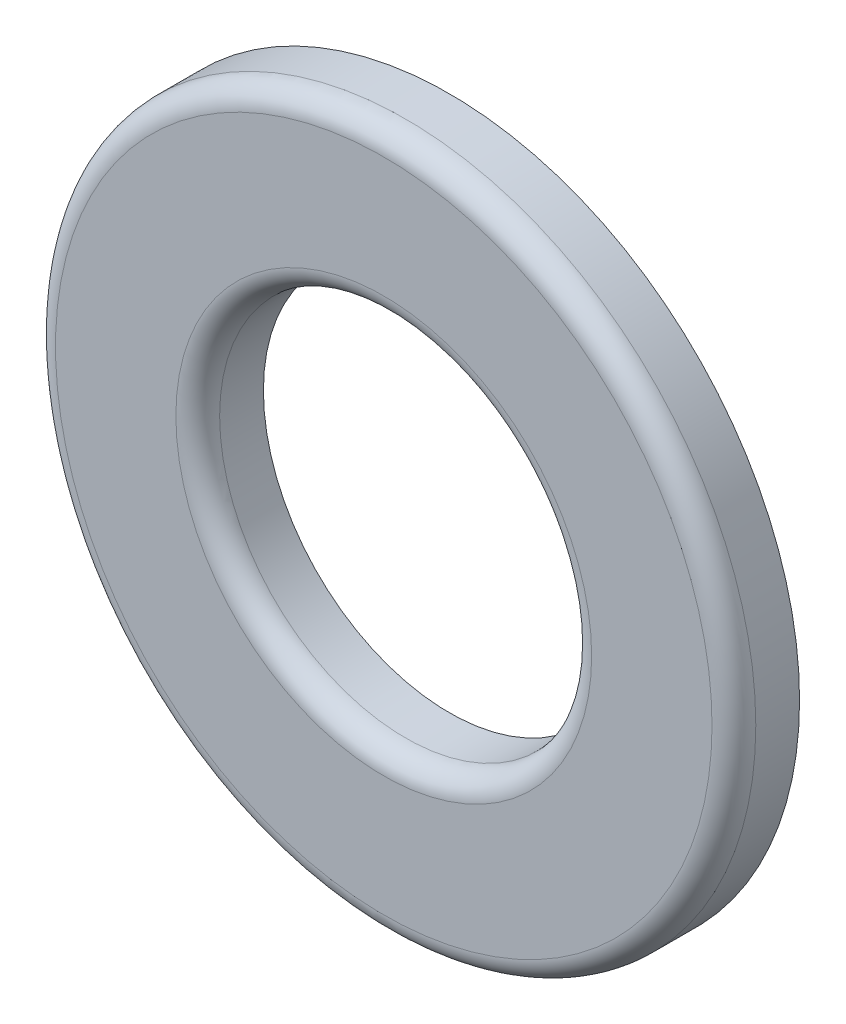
ISO-10303-21;
HEADER;
FILE_DESCRIPTION(('STEP AP214'),'2;1');
FILE_NAME('part.step','',(''),(''),'','','');
FILE_SCHEMA(('AUTOMOTIVE_DESIGN { 1 0 10303 214 1 1 1 1 }'));
ENDSEC;
DATA;
#1=APPLICATION_CONTEXT('core data for automotive mechanical design processes');
#2=APPLICATION_PROTOCOL_DEFINITION('international standard','automotive_design',2000,#1);
#3=PRODUCT_CONTEXT('',#1,'mechanical');
#4=PRODUCT('Part','Part','',(#3));
#5=PRODUCT_RELATED_PRODUCT_CATEGORY('part','',(#4));
#6=PRODUCT_DEFINITION_FORMATION('','',#4);
#7=PRODUCT_DEFINITION_CONTEXT('part definition',#1,'design');
#8=PRODUCT_DEFINITION('design','',#6,#7);
#9=PRODUCT_DEFINITION_SHAPE('','',#8);
#10=(LENGTH_UNIT() NAMED_UNIT(*) SI_UNIT(.MILLI.,.METRE.));
#11=(NAMED_UNIT(*) PLANE_ANGLE_UNIT() SI_UNIT($,.RADIAN.));
#12=(NAMED_UNIT(*) SI_UNIT($,.STERADIAN.) SOLID_ANGLE_UNIT());
#13=UNCERTAINTY_MEASURE_WITH_UNIT(LENGTH_MEASURE(1.E-05),#10,'distance_accuracy_value','');
#14=(GEOMETRIC_REPRESENTATION_CONTEXT(3) GLOBAL_UNCERTAINTY_ASSIGNED_CONTEXT((#13)) GLOBAL_UNIT_ASSIGNED_CONTEXT((#10,
#11,#12)) REPRESENTATION_CONTEXT('',''));
#15=CARTESIAN_POINT('',(0.,0.,0.));
#16=DIRECTION('',(0.,0.,1.));
#17=DIRECTION('',(1.,0.,0.));
#18=AXIS2_PLACEMENT_3D('',#15,#16,#17);
#19=CARTESIAN_POINT('',(-2.22044604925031E-13,7.7715611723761E-13,1.50000000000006));
#20=DIRECTION('',(0.,0.,1.));
#21=DIRECTION('',(1.00000000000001,0.,0.));
#22=AXIS2_PLACEMENT_3D('',#19,#20,#21);
#23=PLANE('',#22);
#24=CARTESIAN_POINT('',(-2.22044604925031E-13,7.7715611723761E-13,1.50000000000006));
#25=DIRECTION('',(0.,0.,1.));
#26=DIRECTION('',(1.00000000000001,0.,0.));
#27=AXIS2_PLACEMENT_3D('',#24,#25,#26);
#28=CIRCLE('',#27,7.5);
#29=CARTESIAN_POINT('',(7.49999999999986,7.57588436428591E-13,1.50000000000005));
#30=VERTEX_POINT('',#29);
#31=EDGE_CURVE('E37',#30,#30,#28,.T.);
#32=ORIENTED_EDGE('',*,*,#31,.T.);
#33=EDGE_LOOP('',(#32));
#34=FACE_BOUND('',#33,.T.);
#35=CARTESIAN_POINT('',(-2.22044604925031E-13,7.7715611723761E-13,1.50000000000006));
#36=DIRECTION('',(0.,0.,1.));
#37=DIRECTION('',(1.00000000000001,0.,0.));
#38=AXIS2_PLACEMENT_3D('',#35,#36,#37);
#39=CIRCLE('',#38,4.75);
#40=CARTESIAN_POINT('',(4.74999999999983,7.64763252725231E-13,1.50000000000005));
#41=VERTEX_POINT('',#40);
#42=EDGE_CURVE('E41',#41,#41,#39,.F.);
#43=ORIENTED_EDGE('',*,*,#42,.T.);
#44=EDGE_LOOP('',(#43));
#45=FACE_BOUND('',#44,.T.);
#46=ADVANCED_FACE('F26',(#34,#45),#23,.T.);
#47=CARTESIAN_POINT('',(-1.55431223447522E-12,6.10622663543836E-13,0.));
#48=DIRECTION('',(0.,0.,1.));
#49=DIRECTION('',(1.00000000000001,0.,0.));
#50=AXIS2_PLACEMENT_3D('',#47,#48,#49);
#51=PLANE('',#50);
#52=CARTESIAN_POINT('',(-1.55431223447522E-12,6.10622663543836E-13,0.));
#53=DIRECTION('',(0.,0.,1.));
#54=DIRECTION('',(1.00000000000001,0.,0.));
#55=AXIS2_PLACEMENT_3D('',#52,#53,#54);
#56=CIRCLE('',#55,8.);
#57=CARTESIAN_POINT('',(7.99999999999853,5.89750470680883E-13,0.));
#58=VERTEX_POINT('',#57);
#59=EDGE_CURVE('E46',#58,#58,#56,.T.);
#60=ORIENTED_EDGE('',*,*,#59,.F.);
#61=EDGE_LOOP('',(#60));
#62=FACE_BOUND('',#61,.T.);
#63=CARTESIAN_POINT('',(-1.55431223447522E-12,6.10622663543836E-13,0.));
#64=DIRECTION('',(0.,0.,1.));
#65=DIRECTION('',(1.00000000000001,0.,0.));
#66=AXIS2_PLACEMENT_3D('',#63,#64,#65);
#67=CIRCLE('',#66,4.25);
#68=CARTESIAN_POINT('',(4.24999999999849,5.99534311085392E-13,0.));
#69=VERTEX_POINT('',#68);
#70=EDGE_CURVE('E49',#69,#69,#67,.T.);
#71=ORIENTED_EDGE('',*,*,#70,.T.);
#72=EDGE_LOOP('',(#71));
#73=FACE_BOUND('',#72,.T.);
#74=ADVANCED_FACE('F53',(#62,#73),#51,.F.);
#75=CARTESIAN_POINT('',(-2.22044604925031E-13,7.7715611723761E-13,1.50000000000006));
#76=DIRECTION('',(0.,0.,-1.));
#77=DIRECTION('',(-1.00000000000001,0.,0.));
#78=AXIS2_PLACEMENT_3D('',#75,#76,#77);
#79=CYLINDRICAL_SURFACE('',#78,8.);
#80=CARTESIAN_POINT('',(0.,6.10622663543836E-13,0.99999999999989));
#81=DIRECTION('',(0.,0.,1.));
#82=DIRECTION('',(1.00000000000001,0.,0.));
#83=AXIS2_PLACEMENT_3D('',#80,#81,#82);
#84=CIRCLE('',#83,8.);
#85=CARTESIAN_POINT('',(8.00000000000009,5.89750470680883E-13,0.999999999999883));
#86=VERTEX_POINT('',#85);
#87=EDGE_CURVE('E33',#86,#86,#84,.F.);
#88=ORIENTED_EDGE('',*,*,#87,.T.);
#89=EDGE_LOOP('',(#88));
#90=FACE_BOUND('',#89,.T.);
#91=ORIENTED_EDGE('',*,*,#59,.T.);
#92=EDGE_LOOP('',(#91));
#93=FACE_BOUND('',#92,.T.);
#94=ADVANCED_FACE('F28',(#90,#93),#79,.T.);
#95=CARTESIAN_POINT('',(-2.22044604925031E-13,7.7715611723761E-13,1.50000000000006));
#96=DIRECTION('',(0.,0.,-1.));
#97=DIRECTION('',(-1.00000000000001,0.,0.));
#98=AXIS2_PLACEMENT_3D('',#95,#96,#97);
#99=CYLINDRICAL_SURFACE('',#98,4.25);
#100=CARTESIAN_POINT('',(0.,6.10622663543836E-13,0.99999999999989));
#101=DIRECTION('',(0.,0.,1.));
#102=DIRECTION('',(1.00000000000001,0.,0.));
#103=AXIS2_PLACEMENT_3D('',#100,#101,#102);
#104=CIRCLE('',#103,4.25);
#105=CARTESIAN_POINT('',(4.25000000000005,5.99534311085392E-13,0.999999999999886));
#106=VERTEX_POINT('',#105);
#107=EDGE_CURVE('E10',#106,#106,#104,.T.);
#108=ORIENTED_EDGE('',*,*,#107,.T.);
#109=EDGE_LOOP('',(#108));
#110=FACE_BOUND('',#109,.T.);
#111=ORIENTED_EDGE('',*,*,#70,.F.);
#112=EDGE_LOOP('',(#111));
#113=FACE_BOUND('',#112,.T.);
#114=ADVANCED_FACE('F55',(#110,#113),#99,.F.);
#115=CARTESIAN_POINT('',(0.,6.10622663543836E-13,0.99999999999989));
#116=DIRECTION('',(0.,0.,1.));
#117=DIRECTION('',(1.00000000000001,0.,0.));
#118=AXIS2_PLACEMENT_3D('',#115,#116,#117);
#119=TOROIDAL_SURFACE('',#118,7.5,0.5);
#120=ORIENTED_EDGE('',*,*,#87,.F.);
#121=EDGE_LOOP('',(#120));
#122=FACE_BOUND('',#121,.T.);
#123=ORIENTED_EDGE('',*,*,#31,.F.);
#124=EDGE_LOOP('',(#123));
#125=FACE_BOUND('',#124,.T.);
#126=ADVANCED_FACE('F57',(#122,#125),#119,.T.);
#127=CARTESIAN_POINT('',(0.,6.10622663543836E-13,0.99999999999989));
#128=DIRECTION('',(0.,0.,1.));
#129=DIRECTION('',(1.00000000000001,0.,0.));
#130=AXIS2_PLACEMENT_3D('',#127,#128,#129);
#131=TOROIDAL_SURFACE('',#130,4.75,0.5);
#132=ORIENTED_EDGE('',*,*,#42,.F.);
#133=EDGE_LOOP('',(#132));
#134=FACE_BOUND('',#133,.T.);
#135=ORIENTED_EDGE('',*,*,#107,.F.);
#136=EDGE_LOOP('',(#135));
#137=FACE_BOUND('',#136,.T.);
#138=ADVANCED_FACE('F63',(#134,#137),#131,.T.);
#139=CLOSED_SHELL('',(#46,#74,#94,#114,#126,#138));
#140=MANIFOLD_SOLID_BREP('B2',#139);
#141=ADVANCED_BREP_SHAPE_REPRESENTATION('',(#18,#140),#14);
#142=SHAPE_DEFINITION_REPRESENTATION(#9,#141);
ENDSEC;
END-ISO-10303-21;
